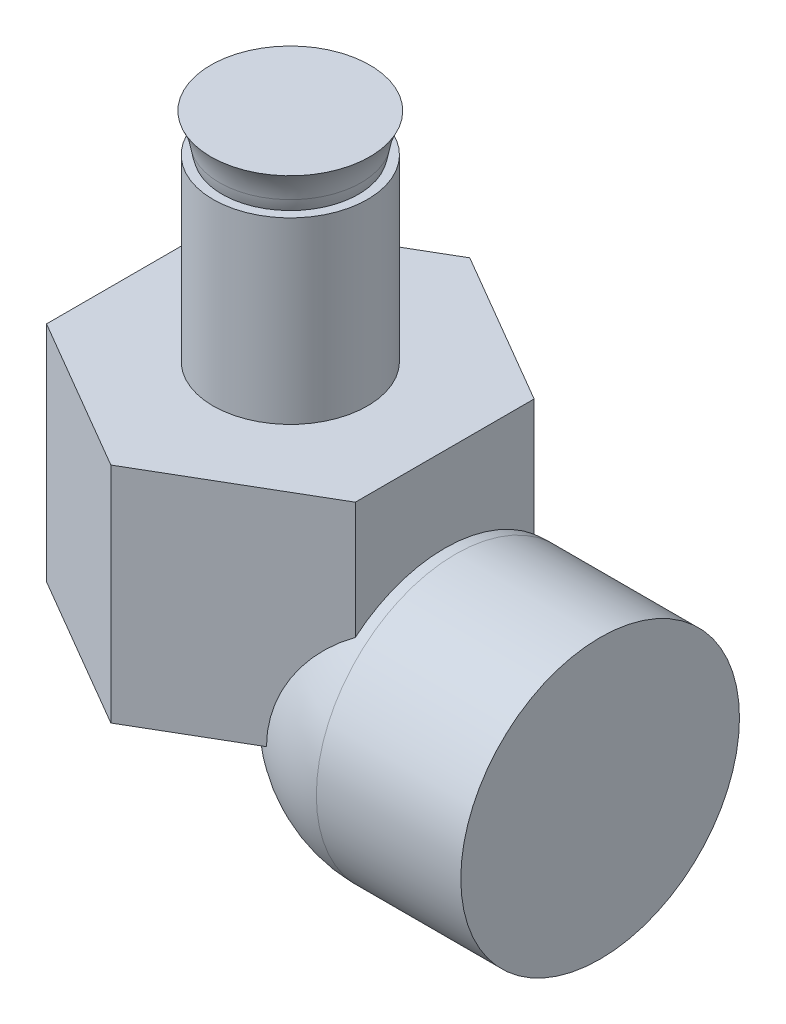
ISO-10303-21;
HEADER;
FILE_DESCRIPTION(('STEP AP214'),'2;1');
FILE_NAME('part.step','',(''),(''),'','','');
FILE_SCHEMA(('AUTOMOTIVE_DESIGN { 1 0 10303 214 1 1 1 1 }'));
ENDSEC;
DATA;
#1=APPLICATION_CONTEXT('core data for automotive mechanical design processes');
#2=APPLICATION_PROTOCOL_DEFINITION('international standard','automotive_design',2000,#1);
#3=PRODUCT_CONTEXT('',#1,'mechanical');
#4=PRODUCT('Part','Part','',(#3));
#5=PRODUCT_RELATED_PRODUCT_CATEGORY('part','',(#4));
#6=PRODUCT_DEFINITION_FORMATION('','',#4);
#7=PRODUCT_DEFINITION_CONTEXT('part definition',#1,'design');
#8=PRODUCT_DEFINITION('design','',#6,#7);
#9=PRODUCT_DEFINITION_SHAPE('','',#8);
#10=(LENGTH_UNIT() NAMED_UNIT(*) SI_UNIT(.MILLI.,.METRE.));
#11=(NAMED_UNIT(*) PLANE_ANGLE_UNIT() SI_UNIT($,.RADIAN.));
#12=(NAMED_UNIT(*) SI_UNIT($,.STERADIAN.) SOLID_ANGLE_UNIT());
#13=UNCERTAINTY_MEASURE_WITH_UNIT(LENGTH_MEASURE(1.E-05),#10,'distance_accuracy_value','');
#14=(GEOMETRIC_REPRESENTATION_CONTEXT(3) GLOBAL_UNCERTAINTY_ASSIGNED_CONTEXT((#13)) GLOBAL_UNIT_ASSIGNED_CONTEXT((#10,
#11,#12)) REPRESENTATION_CONTEXT('',''));
#15=CARTESIAN_POINT('',(0.,0.,0.));
#16=DIRECTION('',(0.,0.,1.));
#17=DIRECTION('',(1.,0.,0.));
#18=AXIS2_PLACEMENT_3D('',#15,#16,#17);
#19=CARTESIAN_POINT('',(0.,50.,-40.1543017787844));
#20=DIRECTION('',(-0.503857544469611,0.,0.863786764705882));
#21=DIRECTION('',(0.863786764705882,0.,0.503857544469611));
#22=AXIS2_PLACEMENT_3D('',#19,#20,#21);
#23=PLANE('',#22);
#24=CARTESIAN_POINT('',(45.0828954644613,0.,-13.8568891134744));
#25=DIRECTION('',(-0.503857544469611,0.,0.863786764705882));
#26=DIRECTION('',(0.863786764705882,0.,0.503857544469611));
#27=AXIS2_PLACEMENT_3D('',#24,#25,#26);
#28=CIRCLE('',#27,26.7352215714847);
#29=CARTESIAN_POINT('',(21.9893649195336,0.,-27.3276322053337));
#30=VERTEX_POINT('',#29);
#31=CARTESIAN_POINT('',(34.5514705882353,23.7933467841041,-20.));
#32=VERTEX_POINT('',#31);
#33=EDGE_CURVE('E143',#30,#32,#28,.F.);
#34=ORIENTED_EDGE('',*,*,#33,.F.);
#35=DIRECTION('',(-0.863786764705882,0.,-0.503857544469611));
#36=VECTOR('',#35,1.);
#37=CARTESIAN_POINT('',(0.,0.,-40.1543017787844));
#38=LINE('',#37,#36);
#39=CARTESIAN_POINT('',(0.,0.,-40.1543017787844));
#40=VERTEX_POINT('',#39);
#41=EDGE_CURVE('E117',#30,#40,#38,.T.);
#42=ORIENTED_EDGE('',*,*,#41,.T.);
#43=DIRECTION('',(0.,-1.,0.));
#44=VECTOR('',#43,1.);
#45=CARTESIAN_POINT('',(0.,50.,-40.1543017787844));
#46=LINE('',#45,#44);
#47=CARTESIAN_POINT('',(0.,50.,-40.1543017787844));
#48=VERTEX_POINT('',#47);
#49=EDGE_CURVE('E38',#48,#40,#46,.T.);
#50=ORIENTED_EDGE('',*,*,#49,.F.);
#51=DIRECTION('',(-0.863786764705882,0.,-0.503857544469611));
#52=VECTOR('',#51,1.);
#53=CARTESIAN_POINT('',(0.,50.,-40.1543017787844));
#54=LINE('',#53,#52);
#55=CARTESIAN_POINT('',(34.5514705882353,50.,-20.));
#56=VERTEX_POINT('',#55);
#57=EDGE_CURVE('E127',#56,#48,#54,.T.);
#58=ORIENTED_EDGE('',*,*,#57,.F.);
#59=DIRECTION('',(0.,-1.,0.));
#60=VECTOR('',#59,1.);
#61=CARTESIAN_POINT('',(34.5514705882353,50.,-20.));
#62=LINE('',#61,#60);
#63=EDGE_CURVE('E113',#56,#32,#62,.T.);
#64=ORIENTED_EDGE('',*,*,#63,.T.);
#65=EDGE_LOOP('',(#34,#42,#50,#58,#64));
#66=FACE_BOUND('',#65,.T.);
#67=ADVANCED_FACE('F31',(#66),#23,.F.);
#68=CARTESIAN_POINT('',(34.5514705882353,50.,20.));
#69=DIRECTION('',(-0.50385754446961,0.,-0.863786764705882));
#70=DIRECTION('',(-0.863786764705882,0.,0.50385754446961));
#71=AXIS2_PLACEMENT_3D('',#68,#69,#70);
#72=PLANE('',#71);
#73=CARTESIAN_POINT('',(45.0828954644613,0.,13.8568891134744));
#74=DIRECTION('',(-0.50385754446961,0.,-0.863786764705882));
#75=DIRECTION('',(-0.863786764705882,0.,0.50385754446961));
#76=AXIS2_PLACEMENT_3D('',#73,#74,#75);
#77=CIRCLE('',#76,26.7352215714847);
#78=CARTESIAN_POINT('',(34.5514705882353,23.7933467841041,20.));
#79=VERTEX_POINT('',#78);
#80=CARTESIAN_POINT('',(21.9893649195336,0.,27.3276322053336));
#81=VERTEX_POINT('',#80);
#82=EDGE_CURVE('E45',#79,#81,#77,.F.);
#83=ORIENTED_EDGE('',*,*,#82,.F.);
#84=DIRECTION('',(0.,-1.,0.));
#85=VECTOR('',#84,1.);
#86=CARTESIAN_POINT('',(34.5514705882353,50.,20.));
#87=LINE('',#86,#85);
#88=CARTESIAN_POINT('',(34.5514705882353,50.,20.));
#89=VERTEX_POINT('',#88);
#90=EDGE_CURVE('E108',#89,#79,#87,.T.);
#91=ORIENTED_EDGE('',*,*,#90,.F.);
#92=DIRECTION('',(0.863786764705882,0.,-0.50385754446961));
#93=VECTOR('',#92,1.);
#94=CARTESIAN_POINT('',(34.5514705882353,50.,20.));
#95=LINE('',#94,#93);
#96=CARTESIAN_POINT('',(0.,50.,40.1543017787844));
#97=VERTEX_POINT('',#96);
#98=EDGE_CURVE('E96',#97,#89,#95,.T.);
#99=ORIENTED_EDGE('',*,*,#98,.F.);
#100=DIRECTION('',(0.,-1.,0.));
#101=VECTOR('',#100,1.);
#102=CARTESIAN_POINT('',(0.,50.,40.1543017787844));
#103=LINE('',#102,#101);
#104=CARTESIAN_POINT('',(0.,0.,40.1543017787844));
#105=VERTEX_POINT('',#104);
#106=EDGE_CURVE('E102',#97,#105,#103,.T.);
#107=ORIENTED_EDGE('',*,*,#106,.T.);
#108=DIRECTION('',(0.863786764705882,0.,-0.50385754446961));
#109=VECTOR('',#108,1.);
#110=CARTESIAN_POINT('',(34.5514705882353,0.,20.));
#111=LINE('',#110,#109);
#112=EDGE_CURVE('E125',#105,#81,#111,.T.);
#113=ORIENTED_EDGE('',*,*,#112,.T.);
#114=EDGE_LOOP('',(#83,#91,#99,#107,#113));
#115=FACE_BOUND('',#114,.T.);
#116=ADVANCED_FACE('F110',(#115),#72,.F.);
#117=CARTESIAN_POINT('',(34.5514705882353,50.,-20.));
#118=DIRECTION('',(-1.,0.,0.));
#119=DIRECTION('',(0.,0.,1.));
#120=AXIS2_PLACEMENT_3D('',#117,#118,#119);
#121=PLANE('',#120);
#122=CARTESIAN_POINT('',(34.5514705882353,0.,0.));
#123=DIRECTION('',(-1.,0.,0.));
#124=DIRECTION('',(0.,0.,1.));
#125=AXIS2_PLACEMENT_3D('',#122,#123,#124);
#126=CIRCLE('',#125,31.0825248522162);
#127=EDGE_CURVE('E120',#32,#79,#126,.F.);
#128=ORIENTED_EDGE('',*,*,#127,.F.);
#129=ORIENTED_EDGE('',*,*,#63,.F.);
#130=DIRECTION('',(0.,0.,-1.));
#131=VECTOR('',#130,1.);
#132=CARTESIAN_POINT('',(34.5514705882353,50.,-20.));
#133=LINE('',#132,#131);
#134=EDGE_CURVE('E53',#89,#56,#133,.T.);
#135=ORIENTED_EDGE('',*,*,#134,.F.);
#136=ORIENTED_EDGE('',*,*,#90,.T.);
#137=EDGE_LOOP('',(#128,#129,#135,#136));
#138=FACE_BOUND('',#137,.T.);
#139=ADVANCED_FACE('F196',(#138),#121,.F.);
#140=CARTESIAN_POINT('',(0.,0.,-40.1543017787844));
#141=DIRECTION('',(0.,-1.,0.));
#142=DIRECTION('',(0.,0.,-1.));
#143=AXIS2_PLACEMENT_3D('',#140,#141,#142);
#144=PLANE('',#143);
#145=ORIENTED_EDGE('',*,*,#41,.F.);
#146=CARTESIAN_POINT('',(37.,0.,0.));
#147=DIRECTION('',(0.,-1.,0.));
#148=DIRECTION('',(0.,0.,-1.));
#149=AXIS2_PLACEMENT_3D('',#146,#147,#148);
#150=CIRCLE('',#149,31.1788172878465);
#151=EDGE_CURVE('E11',#30,#81,#150,.F.);
#152=ORIENTED_EDGE('',*,*,#151,.T.);
#153=ORIENTED_EDGE('',*,*,#112,.F.);
#154=DIRECTION('',(0.863786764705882,0.,0.50385754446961));
#155=VECTOR('',#154,1.);
#156=CARTESIAN_POINT('',(-34.5514705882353,0.,20.));
#157=LINE('',#156,#155);
#158=CARTESIAN_POINT('',(-34.5514705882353,0.,20.));
#159=VERTEX_POINT('',#158);
#160=EDGE_CURVE('E75',#159,#105,#157,.T.);
#161=ORIENTED_EDGE('',*,*,#160,.F.);
#162=DIRECTION('',(0.,0.,1.));
#163=VECTOR('',#162,1.);
#164=CARTESIAN_POINT('',(-34.5514705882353,0.,-20.));
#165=LINE('',#164,#163);
#166=CARTESIAN_POINT('',(-34.5514705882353,0.,-20.));
#167=VERTEX_POINT('',#166);
#168=EDGE_CURVE('E122',#167,#159,#165,.T.);
#169=ORIENTED_EDGE('',*,*,#168,.F.);
#170=DIRECTION('',(-0.863786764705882,0.,0.50385754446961));
#171=VECTOR('',#170,1.);
#172=CARTESIAN_POINT('',(0.,0.,-40.1543017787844));
#173=LINE('',#172,#171);
#174=EDGE_CURVE('E119',#40,#167,#173,.T.);
#175=ORIENTED_EDGE('',*,*,#174,.F.);
#176=EDGE_LOOP('',(#145,#152,#153,#161,#169,#175));
#177=FACE_BOUND('',#176,.T.);
#178=ADVANCED_FACE('F146',(#177),#144,.T.);
#179=CARTESIAN_POINT('',(0.,50.,-40.1543017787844));
#180=DIRECTION('',(0.50385754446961,0.,0.863786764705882));
#181=DIRECTION('',(0.863786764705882,0.,-0.50385754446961));
#182=AXIS2_PLACEMENT_3D('',#179,#180,#181);
#183=PLANE('',#182);
#184=ORIENTED_EDGE('',*,*,#174,.T.);
#185=DIRECTION('',(0.,-1.,0.));
#186=VECTOR('',#185,1.);
#187=CARTESIAN_POINT('',(-34.5514705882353,50.,-20.));
#188=LINE('',#187,#186);
#189=CARTESIAN_POINT('',(-34.5514705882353,50.,-20.));
#190=VERTEX_POINT('',#189);
#191=EDGE_CURVE('E132',#190,#167,#188,.T.);
#192=ORIENTED_EDGE('',*,*,#191,.F.);
#193=DIRECTION('',(-0.863786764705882,0.,0.50385754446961));
#194=VECTOR('',#193,1.);
#195=CARTESIAN_POINT('',(0.,50.,-40.1543017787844));
#196=LINE('',#195,#194);
#197=EDGE_CURVE('E84',#48,#190,#196,.T.);
#198=ORIENTED_EDGE('',*,*,#197,.F.);
#199=ORIENTED_EDGE('',*,*,#49,.T.);
#200=EDGE_LOOP('',(#184,#192,#198,#199));
#201=FACE_BOUND('',#200,.T.);
#202=ADVANCED_FACE('F135',(#201),#183,.F.);
#203=CARTESIAN_POINT('',(-34.5514705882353,50.,-20.));
#204=DIRECTION('',(1.,0.,0.));
#205=DIRECTION('',(0.,0.,-1.));
#206=AXIS2_PLACEMENT_3D('',#203,#204,#205);
#207=PLANE('',#206);
#208=ORIENTED_EDGE('',*,*,#168,.T.);
#209=DIRECTION('',(0.,-1.,0.));
#210=VECTOR('',#209,1.);
#211=CARTESIAN_POINT('',(-34.5514705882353,50.,20.));
#212=LINE('',#211,#210);
#213=CARTESIAN_POINT('',(-34.5514705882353,50.,20.));
#214=VERTEX_POINT('',#213);
#215=EDGE_CURVE('E107',#214,#159,#212,.T.);
#216=ORIENTED_EDGE('',*,*,#215,.F.);
#217=DIRECTION('',(0.,0.,1.));
#218=VECTOR('',#217,1.);
#219=CARTESIAN_POINT('',(-34.5514705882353,50.,-20.));
#220=LINE('',#219,#218);
#221=EDGE_CURVE('E99',#190,#214,#220,.T.);
#222=ORIENTED_EDGE('',*,*,#221,.F.);
#223=ORIENTED_EDGE('',*,*,#191,.T.);
#224=EDGE_LOOP('',(#208,#216,#222,#223));
#225=FACE_BOUND('',#224,.T.);
#226=ADVANCED_FACE('F148',(#225),#207,.F.);
#227=CARTESIAN_POINT('',(-34.5514705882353,50.,20.));
#228=DIRECTION('',(0.50385754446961,0.,-0.863786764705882));
#229=DIRECTION('',(-0.863786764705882,0.,-0.50385754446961));
#230=AXIS2_PLACEMENT_3D('',#227,#228,#229);
#231=PLANE('',#230);
#232=ORIENTED_EDGE('',*,*,#160,.T.);
#233=ORIENTED_EDGE('',*,*,#106,.F.);
#234=DIRECTION('',(0.863786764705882,0.,0.50385754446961));
#235=VECTOR('',#234,1.);
#236=CARTESIAN_POINT('',(-34.5514705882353,50.,20.));
#237=LINE('',#236,#235);
#238=EDGE_CURVE('E93',#214,#97,#237,.T.);
#239=ORIENTED_EDGE('',*,*,#238,.F.);
#240=ORIENTED_EDGE('',*,*,#215,.T.);
#241=EDGE_LOOP('',(#232,#233,#239,#240));
#242=FACE_BOUND('',#241,.T.);
#243=ADVANCED_FACE('F103',(#242),#231,.F.);
#244=CARTESIAN_POINT('',(0.,50.,-40.1543017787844));
#245=DIRECTION('',(0.,-1.,0.));
#246=DIRECTION('',(0.,0.,-1.));
#247=AXIS2_PLACEMENT_3D('',#244,#245,#246);
#248=PLANE('',#247);
#249=CARTESIAN_POINT('',(0.,50.,0.));
#250=DIRECTION('',(0.,1.,0.));
#251=DIRECTION('',(0.,0.,1.));
#252=AXIS2_PLACEMENT_3D('',#249,#250,#251);
#253=CIRCLE('',#252,17.2757352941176);
#254=CARTESIAN_POINT('',(0.,50.,17.2757352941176));
#255=VERTEX_POINT('',#254);
#256=EDGE_CURVE('E173',#255,#255,#253,.T.);
#257=ORIENTED_EDGE('',*,*,#256,.F.);
#258=EDGE_LOOP('',(#257));
#259=FACE_BOUND('',#258,.T.);
#260=ORIENTED_EDGE('',*,*,#57,.T.);
#261=ORIENTED_EDGE('',*,*,#197,.T.);
#262=ORIENTED_EDGE('',*,*,#221,.T.);
#263=ORIENTED_EDGE('',*,*,#238,.T.);
#264=ORIENTED_EDGE('',*,*,#98,.T.);
#265=ORIENTED_EDGE('',*,*,#134,.T.);
#266=EDGE_LOOP('',(#260,#261,#262,#263,#264,#265));
#267=FACE_BOUND('',#266,.T.);
#268=ADVANCED_FACE('F94',(#259,#267),#248,.F.);
#269=CARTESIAN_POINT('',(37.,0.,0.));
#270=DIRECTION('',(-1.,0.,0.));
#271=DIRECTION('',(0.,0.,-1.));
#272=AXIS2_PLACEMENT_3D('',#269,#270,#271);
#273=SPHERICAL_SURFACE('',#272,31.1788172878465);
#274=CARTESIAN_POINT('',(37.,0.,0.));
#275=DIRECTION('',(-1.,0.,0.));
#276=DIRECTION('',(0.,0.,1.));
#277=AXIS2_PLACEMENT_3D('',#274,#275,#276);
#278=CIRCLE('',#277,31.1788172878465);
#279=CARTESIAN_POINT('',(37.,0.,31.1788172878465));
#280=VERTEX_POINT('',#279);
#281=EDGE_CURVE('E158',#280,#280,#278,.T.);
#282=ORIENTED_EDGE('',*,*,#281,.T.);
#283=EDGE_LOOP('',(#282));
#284=FACE_BOUND('',#283,.T.);
#285=ORIENTED_EDGE('',*,*,#33,.T.);
#286=ORIENTED_EDGE('',*,*,#127,.T.);
#287=ORIENTED_EDGE('',*,*,#82,.T.);
#288=ORIENTED_EDGE('',*,*,#151,.F.);
#289=EDGE_LOOP('',(#285,#286,#287,#288));
#290=FACE_BOUND('',#289,.T.);
#291=ADVANCED_FACE('F181',(#284,#290),#273,.T.);
#292=CARTESIAN_POINT('',(69.3270755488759,0.,-31.1788172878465));
#293=DIRECTION('',(-1.,0.,0.));
#294=DIRECTION('',(0.,0.,1.));
#295=AXIS2_PLACEMENT_3D('',#292,#293,#294);
#296=PLANE('',#295);
#297=CARTESIAN_POINT('',(69.3270755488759,0.,0.));
#298=DIRECTION('',(-1.,0.,0.));
#299=DIRECTION('',(0.,0.,1.));
#300=AXIS2_PLACEMENT_3D('',#297,#298,#299);
#301=CIRCLE('',#300,31.1788172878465);
#302=CARTESIAN_POINT('',(69.3270755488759,0.,31.1788172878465));
#303=VERTEX_POINT('',#302);
#304=EDGE_CURVE('E155',#303,#303,#301,.T.);
#305=ORIENTED_EDGE('',*,*,#304,.F.);
#306=EDGE_LOOP('',(#305));
#307=FACE_BOUND('',#306,.T.);
#308=ADVANCED_FACE('F187',(#307),#296,.F.);
#309=CARTESIAN_POINT('',(-29.6672168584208,0.,0.));
#310=DIRECTION('',(-1.,0.,0.));
#311=DIRECTION('',(0.,0.,1.));
#312=AXIS2_PLACEMENT_3D('',#309,#310,#311);
#313=CYLINDRICAL_SURFACE('',#312,31.1788172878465);
#314=ORIENTED_EDGE('',*,*,#281,.F.);
#315=EDGE_LOOP('',(#314));
#316=FACE_BOUND('',#315,.T.);
#317=ORIENTED_EDGE('',*,*,#304,.T.);
#318=EDGE_LOOP('',(#317));
#319=FACE_BOUND('',#318,.T.);
#320=ADVANCED_FACE('F253',(#316,#319),#313,.T.);
#321=CARTESIAN_POINT('',(-17.7915245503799,98.5449534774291,0.));
#322=DIRECTION('',(0.,1.,0.));
#323=DIRECTION('',(0.,0.,1.));
#324=AXIS2_PLACEMENT_3D('',#321,#322,#323);
#325=PLANE('',#324);
#326=CARTESIAN_POINT('',(0.,98.5449534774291,0.));
#327=DIRECTION('',(0.,1.,0.));
#328=DIRECTION('',(0.,0.,1.));
#329=AXIS2_PLACEMENT_3D('',#326,#327,#328);
#330=CIRCLE('',#329,17.7915245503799);
#331=CARTESIAN_POINT('',(0.,98.5449534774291,17.7915245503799));
#332=VERTEX_POINT('',#331);
#333=EDGE_CURVE('E161',#332,#332,#330,.T.);
#334=ORIENTED_EDGE('',*,*,#333,.T.);
#335=EDGE_LOOP('',(#334));
#336=FACE_BOUND('',#335,.T.);
#337=ADVANCED_FACE('F258',(#336),#325,.T.);
#338=CARTESIAN_POINT('',(0.,89.9822556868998,0.));
#339=DIRECTION('',(0.,1.,0.));
#340=DIRECTION('',(0.,0.,1.));
#341=AXIS2_PLACEMENT_3D('',#338,#339,#340);
#342=TOROIDAL_SURFACE('',#341,33.9284744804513,18.26803072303);
#343=CARTESIAN_POINT('',(0.,92.5426879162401,0.));
#344=DIRECTION('',(0.,1.,0.));
#345=DIRECTION('',(0.,0.,1.));
#346=AXIS2_PLACEMENT_3D('',#343,#344,#345);
#347=CIRCLE('',#346,15.8407677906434);
#348=CARTESIAN_POINT('',(-15.8407677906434,92.5426879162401,0.));
#349=VERTEX_POINT('',#348);
#350=EDGE_CURVE('E164',#349,#349,#347,.T.);
#351=ORIENTED_EDGE('',*,*,#350,.T.);
#352=EDGE_LOOP('',(#351));
#353=FACE_BOUND('',#352,.T.);
#354=ORIENTED_EDGE('',*,*,#333,.F.);
#355=EDGE_LOOP('',(#354));
#356=FACE_BOUND('',#355,.T.);
#357=ADVANCED_FACE('F263',(#353,#356),#342,.F.);
#358=CARTESIAN_POINT('',(0.,94.7850513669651,0.));
#359=DIRECTION('',(0.,1.,0.));
#360=DIRECTION('',(-1.,0.,0.));
#361=AXIS2_PLACEMENT_3D('',#358,#359,#360);
#362=SPHERICAL_SURFACE('',#361,15.9986911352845);
#363=CARTESIAN_POINT('',(0.,90.023752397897,0.));
#364=DIRECTION('',(0.,1.,0.));
#365=DIRECTION('',(0.,0.,1.));
#366=AXIS2_PLACEMENT_3D('',#363,#364,#365);
#367=CIRCLE('',#366,15.2737732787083);
#368=CARTESIAN_POINT('',(-15.2737732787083,90.023752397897,0.));
#369=VERTEX_POINT('',#368);
#370=EDGE_CURVE('E167',#369,#369,#367,.T.);
#371=CARTESIAN_POINT('',(-15.2737732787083,90.023752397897,0.));
#372=CARTESIAN_POINT('',(-15.2817862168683,90.0494571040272,0.));
#373=CARTESIAN_POINT('',(-15.2897342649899,90.0751820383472,0.));
#374=CARTESIAN_POINT('',(-15.3055003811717,90.1266717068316,0.));
#375=CARTESIAN_POINT('',(-15.3133184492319,90.1524364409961,0.));
#376=CARTESIAN_POINT('',(-15.3288244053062,90.2040050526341,0.));
#377=CARTESIAN_POINT('',(-15.3365122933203,90.2298089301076,0.));
#378=CARTESIAN_POINT('',(-15.3517576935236,90.281455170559,0.));
#379=CARTESIAN_POINT('',(-15.3593152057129,90.3072975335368,0.));
#380=CARTESIAN_POINT('',(-15.3742996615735,90.3590200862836,0.));
#381=CARTESIAN_POINT('',(-15.3817266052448,90.3849002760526,0.));
#382=CARTESIAN_POINT('',(-15.3964497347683,90.436697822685,0.));
#383=CARTESIAN_POINT('',(-15.4037459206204,90.4626151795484,0.));
#384=CARTESIAN_POINT('',(-15.4182073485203,90.5144863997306,0.));
#385=CARTESIAN_POINT('',(-15.425372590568,90.5404402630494,0.));
#386=CARTESIAN_POINT('',(-15.439571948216,90.5923838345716,0.));
#387=CARTESIAN_POINT('',(-15.4466060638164,90.6183735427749,0.));
#388=CARTESIAN_POINT('',(-15.4605429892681,90.6703881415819,0.));
#389=CARTESIAN_POINT('',(-15.4674457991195,90.6964130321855,0.));
#390=CARTESIAN_POINT('',(-15.4811199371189,90.7484973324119,0.));
#391=CARTESIAN_POINT('',(-15.4878912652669,90.7745567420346,0.));
#392=CARTESIAN_POINT('',(-15.5013022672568,90.8267094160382,0.));
#393=CARTESIAN_POINT('',(-15.5079419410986,90.852802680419,0.));
#394=CARTESIAN_POINT('',(-15.521089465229,90.9050223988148,0.));
#395=CARTESIAN_POINT('',(-15.5275973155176,90.9311488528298,0.));
#396=CARTESIAN_POINT('',(-15.5404810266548,90.9834342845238,0.));
#397=CARTESIAN_POINT('',(-15.5468568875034,91.0095932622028,0.));
#398=CARTESIAN_POINT('',(-15.5594764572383,91.061943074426,0.));
#399=CARTESIAN_POINT('',(-15.5657201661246,91.0881339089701,0.));
#400=CARTESIAN_POINT('',(-15.5780752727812,91.1405467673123,0.));
#401=CARTESIAN_POINT('',(-15.5841866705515,91.1667687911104,0.));
#402=CARTESIAN_POINT('',(-15.5962769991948,91.2192433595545,0.));
#403=CARTESIAN_POINT('',(-15.6022559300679,91.2454959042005,0.));
#404=CARTESIAN_POINT('',(-15.6140811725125,91.2980308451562,0.));
#405=CARTESIAN_POINT('',(-15.619927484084,91.3243132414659,0.));
#406=CARTESIAN_POINT('',(-15.6314873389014,91.3769072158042,0.));
#407=CARTESIAN_POINT('',(-15.6372008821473,91.4032187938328,0.));
#408=CARTESIAN_POINT('',(-15.6484950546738,91.4558704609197,0.));
#409=CARTESIAN_POINT('',(-15.6540756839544,91.4822105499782,0.));
#410=CARTESIAN_POINT('',(-15.6651038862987,91.5349185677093,0.));
#411=CARTESIAN_POINT('',(-15.6705514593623,91.5612864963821,0.));
#412=CARTESIAN_POINT('',(-15.6813134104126,91.6140495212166,0.));
#413=CARTESIAN_POINT('',(-15.6866277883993,91.6404446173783,0.));
#414=CARTESIAN_POINT('',(-15.6971232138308,91.6932613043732,0.));
#415=CARTESIAN_POINT('',(-15.7023042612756,91.7196828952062,0.));
#416=CARTESIAN_POINT('',(-15.7125328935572,91.7725518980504,0.));
#417=CARTESIAN_POINT('',(-15.7175804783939,91.7989993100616,0.));
#418=CARTESIAN_POINT('',(-15.7275420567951,91.8519192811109,0.));
#419=CARTESIAN_POINT('',(-15.7324560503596,91.8783918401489,0.));
#420=CARTESIAN_POINT('',(-15.7421503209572,91.9313614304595,0.));
#421=CARTESIAN_POINT('',(-15.7469305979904,91.9578584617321,0.));
#422=CARTESIAN_POINT('',(-15.7563573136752,92.0108763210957,0.));
#423=CARTESIAN_POINT('',(-15.7610037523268,92.0373971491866,0.));
#424=CARTESIAN_POINT('',(-15.7701626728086,92.0904619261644,0.));
#425=CARTESIAN_POINT('',(-15.7746751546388,92.1170058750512,0.));
#426=CARTESIAN_POINT('',(-15.7835660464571,92.1701162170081,0.));
#427=CARTESIAN_POINT('',(-15.7879444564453,92.1966826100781,0.));
#428=CARTESIAN_POINT('',(-15.7965670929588,92.2498371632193,0.));
#429=CARTESIAN_POINT('',(-15.8008113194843,92.2764253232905,0.));
#430=CARTESIAN_POINT('',(-15.8091654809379,92.3296227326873,0.));
#431=CARTESIAN_POINT('',(-15.8132754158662,92.3562319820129,0.));
#432=CARTESIAN_POINT('',(-15.8213608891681,92.4094708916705,0.));
#433=CARTESIAN_POINT('',(-15.8253364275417,92.4361005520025,0.));
#434=CARTESIAN_POINT('',(-15.8331530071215,92.4893796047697,0.));
#435=CARTESIAN_POINT('',(-15.8369940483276,92.5160289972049,0.));
#436=CARTESIAN_POINT('',(-15.8407677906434,92.5426879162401,0.));
#437=B_SPLINE_CURVE_WITH_KNOTS('',3,(#371,#372,#373,#374,#375,#376,#377,#378,#379,#380,#381,
#382,#383,#384,#385,#386,#387,#388,#389,#390,#391,#392,#393,#394,#395,#396,#397,#398,#399,#400,
#401,#402,#403,#404,#405,#406,#407,#408,#409,#410,#411,#412,#413,#414,#415,#416,#417,#418,#419,
#420,#421,#422,#423,#424,#425,#426,#427,#428,#429,#430,#431,#432,#433,#434,#435,#436),
.UNSPECIFIED.,.F.,.F.,(4,2,2,2,2,2,2,2,2,2,2,2,2,2,2,2,2,2,2,2,2,2,2,2,2,2,2,2,2,2,2,2,4),(0.,
0.0807739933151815,0.161547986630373,0.24232197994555,0.323095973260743,0.403869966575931,
0.484643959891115,0.565417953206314,0.646191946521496,0.726965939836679,0.807739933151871,
0.88851392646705,0.969287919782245,1.05006191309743,1.13083590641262,1.21160989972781,
1.29238389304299,1.37315788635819,1.45393187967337,1.53470587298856,1.61547986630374,
1.69625385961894,1.77702785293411,1.8578018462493,1.93857583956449,2.01934983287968,
2.10012382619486,2.18089781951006,2.26167181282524,2.34244580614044,2.42321979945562,
2.50399379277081,2.584767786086),.UNSPECIFIED.);
#438=EDGE_CURVE('BSEAM273',#369,#349,#437,.T.);
#439=ORIENTED_EDGE('',*,*,#370,.T.);
#440=ORIENTED_EDGE('',*,*,#350,.F.);
#441=ORIENTED_EDGE('',*,*,#438,.T.);
#442=ORIENTED_EDGE('',*,*,#438,.F.);
#443=EDGE_LOOP('',(#439,#441,#440,#442));
#444=FACE_BOUND('',#443,.T.);
#445=ADVANCED_FACE('F273',(#444),#362,.T.);
#446=CARTESIAN_POINT('',(-17.2757352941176,90.023752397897,0.));
#447=DIRECTION('',(0.,1.,0.));
#448=DIRECTION('',(0.,0.,1.));
#449=AXIS2_PLACEMENT_3D('',#446,#447,#448);
#450=PLANE('',#449);
#451=CARTESIAN_POINT('',(0.,90.023752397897,0.));
#452=DIRECTION('',(0.,1.,0.));
#453=DIRECTION('',(0.,0.,1.));
#454=AXIS2_PLACEMENT_3D('',#451,#452,#453);
#455=CIRCLE('',#454,17.2757352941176);
#456=CARTESIAN_POINT('',(0.,90.023752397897,17.2757352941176));
#457=VERTEX_POINT('',#456);
#458=EDGE_CURVE('E170',#457,#457,#455,.T.);
#459=ORIENTED_EDGE('',*,*,#458,.T.);
#460=EDGE_LOOP('',(#459));
#461=FACE_BOUND('',#460,.T.);
#462=ORIENTED_EDGE('',*,*,#370,.F.);
#463=EDGE_LOOP('',(#462));
#464=FACE_BOUND('',#463,.T.);
#465=ADVANCED_FACE('F283',(#461,#464),#450,.T.);
#466=CARTESIAN_POINT('',(0.,131.495262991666,0.));
#467=DIRECTION('',(0.,1.,0.));
#468=DIRECTION('',(0.,0.,1.));
#469=AXIS2_PLACEMENT_3D('',#466,#467,#468);
#470=CYLINDRICAL_SURFACE('',#469,17.2757352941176);
#471=ORIENTED_EDGE('',*,*,#256,.T.);
#472=EDGE_LOOP('',(#471));
#473=FACE_BOUND('',#472,.T.);
#474=ORIENTED_EDGE('',*,*,#458,.F.);
#475=EDGE_LOOP('',(#474));
#476=FACE_BOUND('',#475,.T.);
#477=ADVANCED_FACE('F177',(#473,#476),#470,.T.);
#478=CLOSED_SHELL('',(#67,#116,#139,#178,#202,#226,#243,#268,#291,#308,#320,#337,#357,#445,#465,#477));
#479=MANIFOLD_SOLID_BREP('B2',#478);
#480=ADVANCED_BREP_SHAPE_REPRESENTATION('',(#18,#479),#14);
#481=SHAPE_DEFINITION_REPRESENTATION(#9,#480);
ENDSEC;
END-ISO-10303-21;
